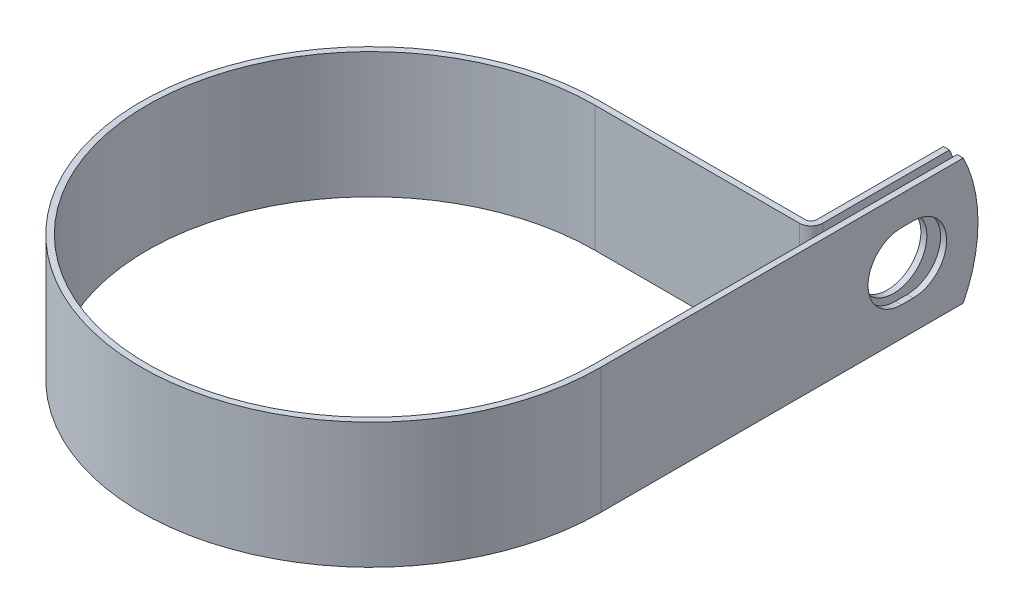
from build123d import *

# Parameters (mm, degrees)
EXTRUDE_THIN1_DEPTH = 12.7
SKETCH2_R           = 6.7437
CUT_EXTRUDE1_DEPTH  = 1.2192
CUT_EXTRUDE2_REACH  = 122.817
CUT_EXTRUDE3_DEPTH  = 118.758522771


with BuildPart() as part:
    # Sketch1 → Extrude-Thin1 (new, symmetric)
    with BuildSketch(Plane(origin=(0, 0, 0), x_dir=(1, 0, 0), z_dir=(0, 1, 0))):
        with BuildLine():
            Line((45.2374, 76.1746), (45.2374, 45.2374))
            Line((45.2374, 45.2374), (45.2374, 0))
            ThreePointArc((45.2374, 0), (-31.987672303, -31.987672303), (0, 45.2374))
            Line((0, 45.2374), (41.28516, 45.2374))
            ThreePointArc((41.28516, 45.2374), (42.966263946, 45.933736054), (43.6626, 47.61484))
            Line((43.6626, 47.61484), (43.6626, 76.1746))
            Line((43.6626, 76.1746), (42.4434, 76.1746))
            Line((42.4434, 76.1746), (42.4434, 47.61484))
            ThreePointArc((42.4434, 47.61484), (42.104159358, 46.795840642), (41.28516, 46.4566))
            Line((41.28516, 46.4566), (0, 46.4566))
            ThreePointArc((0, 46.4566), (-32.849776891, -32.849776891), (46.4566, 0))
            Line((46.4566, 0), (46.4566, 45.2374))
            Line((46.4566, 45.2374), (46.4566, 76.1746))
            Line((46.4566, 76.1746), (45.2374, 76.1746))
        make_face()
    extrude(amount=EXTRUDE_THIN1_DEPTH, both=True)

    # Sketch2 → Cut-Extrude1 (cut)
    with BuildSketch(Plane.ZY.offset(-42.4434)):
        with Locations((-61.8998, 0)):
            Circle(SKETCH2_R)
    extrude(amount=-CUT_EXTRUDE1_DEPTH, mode=Mode.SUBTRACT)

    # Sketch3 → Cut-Extrude2 (cut, up to next)
    with BuildSketch(Plane(origin=(46.4566, 0, 0), x_dir=(0, 0, -1), z_dir=(1, 0, 0)), mode=Mode.PRIVATE) as cut_extrude2_sk1:
        with BuildLine():
            Line((60.706, 6.7437), (63.0936, 6.7437))
            ThreePointArc((63.0936, 6.7437), (69.8373, 0), (63.0936, -6.7437))
            Line((63.0936, -6.7437), (60.706, -6.7437))
            ThreePointArc((60.706, -6.7437), (53.9623, 0), (60.706, 6.7437))
        make_face()
    cut_extrude2_tool1 = extrude(cut_extrude2_sk1.sketch, amount=-CUT_EXTRUDE2_REACH, mode=Mode.PRIVATE) & part.part
    add(cut_extrude2_tool1.solids().sort_by_distance((46.4566, 0, -61.8998))[0], mode=Mode.SUBTRACT)

    # Sketch4 → Cut-Extrude3 (cut, through all)
    with BuildSketch(Plane.ZY.offset(-42.4434)):
        with BuildLine():
            Line((-73.197268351, 12.7), (-76.1746, 12.7))
            Line((-76.1746, 12.7), (-76.1746, 0))
            ThreePointArc((-76.1746, 0), (-75.420311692, 6.522164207), (-73.197268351, 12.7))
        make_face()
        with BuildLine():
            ThreePointArc((-73.197268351, -12.7), (-75.420311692, -6.522164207), (-76.1746, 0))
            Line((-76.1746, 0), (-76.1746, -12.7))
            Line((-76.1746, -12.7), (-73.197268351, -12.7))
        make_face()
    extrude(amount=-CUT_EXTRUDE3_DEPTH, mode=Mode.SUBTRACT)


solid = part.part
